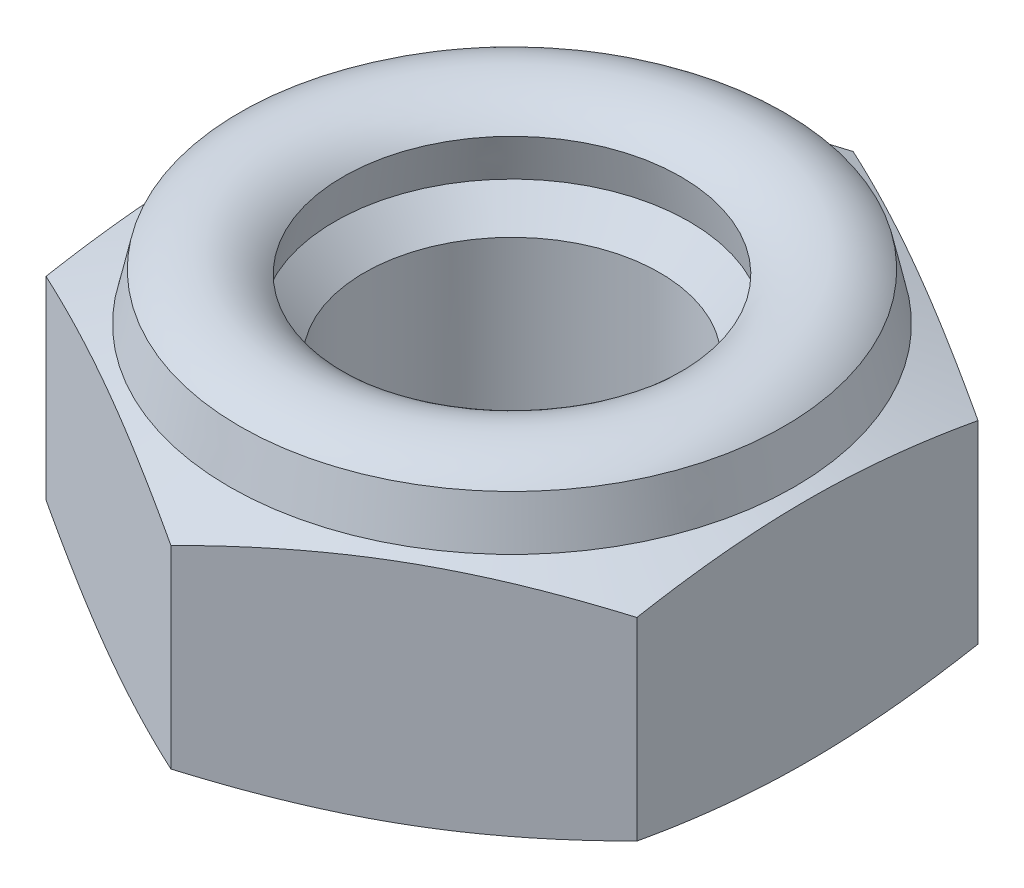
ISO-10303-21;
HEADER;
FILE_DESCRIPTION(('STEP AP214'),'2;1');
FILE_NAME('part.step','',(''),(''),'','','');
FILE_SCHEMA(('AUTOMOTIVE_DESIGN { 1 0 10303 214 1 1 1 1 }'));
ENDSEC;
DATA;
#1=APPLICATION_CONTEXT('core data for automotive mechanical design processes');
#2=APPLICATION_PROTOCOL_DEFINITION('international standard','automotive_design',2000,#1);
#3=PRODUCT_CONTEXT('',#1,'mechanical');
#4=PRODUCT('Part','Part','',(#3));
#5=PRODUCT_RELATED_PRODUCT_CATEGORY('part','',(#4));
#6=PRODUCT_DEFINITION_FORMATION('','',#4);
#7=PRODUCT_DEFINITION_CONTEXT('part definition',#1,'design');
#8=PRODUCT_DEFINITION('design','',#6,#7);
#9=PRODUCT_DEFINITION_SHAPE('','',#8);
#10=(LENGTH_UNIT() NAMED_UNIT(*) SI_UNIT(.MILLI.,.METRE.));
#11=(NAMED_UNIT(*) PLANE_ANGLE_UNIT() SI_UNIT($,.RADIAN.));
#12=(NAMED_UNIT(*) SI_UNIT($,.STERADIAN.) SOLID_ANGLE_UNIT());
#13=UNCERTAINTY_MEASURE_WITH_UNIT(LENGTH_MEASURE(1.E-05),#10,'distance_accuracy_value','');
#14=(GEOMETRIC_REPRESENTATION_CONTEXT(3) GLOBAL_UNCERTAINTY_ASSIGNED_CONTEXT((#13)) GLOBAL_UNIT_ASSIGNED_CONTEXT((#10,
#11,#12)) REPRESENTATION_CONTEXT('',''));
#15=CARTESIAN_POINT('',(0.,0.,0.));
#16=DIRECTION('',(0.,0.,1.));
#17=DIRECTION('',(1.,0.,0.));
#18=AXIS2_PLACEMENT_3D('',#15,#16,#17);
#19=CARTESIAN_POINT('',(-2.,1.6,1.15470053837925));
#20=DIRECTION('',(0.5,0.,-0.866025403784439));
#21=DIRECTION('',(-0.866025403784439,0.,-0.5));
#22=AXIS2_PLACEMENT_3D('',#19,#20,#21);
#23=PLANE('',#22);
#24=CARTESIAN_POINT('',(0.0002,0.144534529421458,2.30951654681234));
#25=CARTESIAN_POINT('',(-0.0826408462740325,0.127118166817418,2.26168836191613));
#26=CARTESIAN_POINT('',(-0.165754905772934,0.111274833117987,2.213702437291));
#27=CARTESIAN_POINT('',(-0.332523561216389,0.0834007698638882,2.11741850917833));
#28=CARTESIAN_POINT('',(-0.416178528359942,0.0713730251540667,2.06912029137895));
#29=CARTESIAN_POINT('',(-0.583100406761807,0.0519184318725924,1.97274789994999));
#30=CARTESIAN_POINT('',(-0.666363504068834,0.0444491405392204,1.92467592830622));
#31=CARTESIAN_POINT('',(-0.833084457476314,0.0344307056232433,1.82841954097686));
#32=CARTESIAN_POINT('',(-0.916542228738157,0.0318797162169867,1.78023517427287));
#33=CARTESIAN_POINT('',(-1.08345777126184,0.0318797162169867,1.68386644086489));
#34=CARTESIAN_POINT('',(-1.16691554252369,0.0344307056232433,1.6356820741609));
#35=CARTESIAN_POINT('',(-1.33363649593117,0.0444491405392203,1.53942568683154));
#36=CARTESIAN_POINT('',(-1.41689959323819,0.0519184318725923,1.49135371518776));
#37=CARTESIAN_POINT('',(-1.58382147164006,0.0713730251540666,1.39498132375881));
#38=CARTESIAN_POINT('',(-1.66747643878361,0.0834007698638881,1.34668310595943));
#39=CARTESIAN_POINT('',(-1.83424509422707,0.111274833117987,1.25039917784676));
#40=CARTESIAN_POINT('',(-1.91735915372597,0.127118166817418,1.20241325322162));
#41=CARTESIAN_POINT('',(-2.0002,0.144534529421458,1.15458506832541));
#42=B_SPLINE_CURVE_WITH_KNOTS('',3,(#24,#25,#26,#27,#28,#29,#30,#31,#32,#33,#34,#35,#36,#37,#38,
#39,#40,#41),.UNSPECIFIED.,.F.,.F.,(4,2,2,2,2,2,2,2,4),(0.,0.291716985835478,0.583661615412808,
0.872844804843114,1.16191944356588,1.45099408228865,1.74017727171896,2.03212190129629,
2.32383888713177),.UNSPECIFIED.);
#43=CARTESIAN_POINT('',(0.,0.144492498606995,2.3094010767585));
#44=VERTEX_POINT('',#43);
#45=CARTESIAN_POINT('',(-2.,0.144492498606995,1.15470053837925));
#46=VERTEX_POINT('',#45);
#47=EDGE_CURVE('E49',#44,#46,#42,.T.);
#48=ORIENTED_EDGE('',*,*,#47,.F.);
#49=DIRECTION('',(0.,-1.,0.));
#50=VECTOR('',#49,1.);
#51=CARTESIAN_POINT('',(0.,1.6,2.3094010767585));
#52=LINE('',#51,#50);
#53=CARTESIAN_POINT('',(0.,1.45550750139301,2.3094010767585));
#54=VERTEX_POINT('',#53);
#55=EDGE_CURVE('E98',#54,#44,#52,.T.);
#56=ORIENTED_EDGE('',*,*,#55,.F.);
#57=CARTESIAN_POINT('',(-2.0002,1.45546547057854,1.15458506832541));
#58=CARTESIAN_POINT('',(-1.91735915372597,1.47288183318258,1.20241325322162));
#59=CARTESIAN_POINT('',(-1.83424509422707,1.48872516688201,1.25039917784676));
#60=CARTESIAN_POINT('',(-1.66747643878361,1.51659923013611,1.34668310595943));
#61=CARTESIAN_POINT('',(-1.58382147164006,1.52862697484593,1.39498132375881));
#62=CARTESIAN_POINT('',(-1.41689959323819,1.54808156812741,1.49135371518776));
#63=CARTESIAN_POINT('',(-1.33363649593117,1.55555085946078,1.53942568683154));
#64=CARTESIAN_POINT('',(-1.16691554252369,1.56556929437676,1.6356820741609));
#65=CARTESIAN_POINT('',(-1.08345777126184,1.56812028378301,1.68386644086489));
#66=CARTESIAN_POINT('',(-0.916542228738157,1.56812028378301,1.78023517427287));
#67=CARTESIAN_POINT('',(-0.833084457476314,1.56556929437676,1.82841954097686));
#68=CARTESIAN_POINT('',(-0.666363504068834,1.55555085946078,1.92467592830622));
#69=CARTESIAN_POINT('',(-0.583100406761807,1.54808156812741,1.97274789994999));
#70=CARTESIAN_POINT('',(-0.416178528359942,1.52862697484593,2.06912029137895));
#71=CARTESIAN_POINT('',(-0.332523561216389,1.51659923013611,2.11741850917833));
#72=CARTESIAN_POINT('',(-0.165754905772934,1.48872516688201,2.213702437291));
#73=CARTESIAN_POINT('',(-0.0826408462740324,1.47288183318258,2.26168836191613));
#74=CARTESIAN_POINT('',(0.000200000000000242,1.45546547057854,2.30951654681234));
#75=B_SPLINE_CURVE_WITH_KNOTS('',3,(#57,#58,#59,#60,#61,#62,#63,#64,#65,#66,#67,#68,#69,#70,#71,
#72,#73,#74),.UNSPECIFIED.,.F.,.F.,(4,2,2,2,2,2,2,2,4),(0.,0.291716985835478,0.583661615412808,
0.872844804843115,1.16191944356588,1.45099408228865,1.74017727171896,2.03212190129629,
2.32383888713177),.UNSPECIFIED.);
#76=CARTESIAN_POINT('',(-2.,1.45550750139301,1.15470053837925));
#77=VERTEX_POINT('',#76);
#78=EDGE_CURVE('E241',#77,#54,#75,.T.);
#79=ORIENTED_EDGE('',*,*,#78,.F.);
#80=DIRECTION('',(0.,-1.,0.));
#81=VECTOR('',#80,1.);
#82=CARTESIAN_POINT('',(-2.,1.6,1.15470053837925));
#83=LINE('',#82,#81);
#84=EDGE_CURVE('E100',#77,#46,#83,.T.);
#85=ORIENTED_EDGE('',*,*,#84,.T.);
#86=EDGE_LOOP('',(#48,#56,#79,#85));
#87=FACE_BOUND('',#86,.T.);
#88=ADVANCED_FACE('F34',(#87),#23,.F.);
#89=CARTESIAN_POINT('',(0.,1.6,2.3094010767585));
#90=DIRECTION('',(-0.5,0.,-0.866025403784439));
#91=DIRECTION('',(-0.866025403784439,0.,0.5));
#92=AXIS2_PLACEMENT_3D('',#89,#90,#91);
#93=PLANE('',#92);
#94=CARTESIAN_POINT('',(2.0002,0.144534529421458,1.15458506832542));
#95=CARTESIAN_POINT('',(1.91735915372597,0.127118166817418,1.20241325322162));
#96=CARTESIAN_POINT('',(1.83424509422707,0.111274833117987,1.25039917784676));
#97=CARTESIAN_POINT('',(1.66747643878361,0.0834007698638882,1.34668310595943));
#98=CARTESIAN_POINT('',(1.58382147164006,0.0713730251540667,1.39498132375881));
#99=CARTESIAN_POINT('',(1.41689959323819,0.0519184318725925,1.49135371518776));
#100=CARTESIAN_POINT('',(1.33363649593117,0.0444491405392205,1.53942568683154));
#101=CARTESIAN_POINT('',(1.16691554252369,0.0344307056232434,1.6356820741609));
#102=CARTESIAN_POINT('',(1.08345777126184,0.0318797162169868,1.68386644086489));
#103=CARTESIAN_POINT('',(0.916542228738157,0.0318797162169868,1.78023517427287));
#104=CARTESIAN_POINT('',(0.833084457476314,0.0344307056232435,1.82841954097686));
#105=CARTESIAN_POINT('',(0.666363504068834,0.0444491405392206,1.92467592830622));
#106=CARTESIAN_POINT('',(0.583100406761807,0.0519184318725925,1.97274789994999));
#107=CARTESIAN_POINT('',(0.416178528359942,0.0713730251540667,2.06912029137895));
#108=CARTESIAN_POINT('',(0.332523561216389,0.0834007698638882,2.11741850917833));
#109=CARTESIAN_POINT('',(0.165754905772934,0.111274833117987,2.213702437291));
#110=CARTESIAN_POINT('',(0.0826408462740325,0.127118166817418,2.26168836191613));
#111=CARTESIAN_POINT('',(-0.000199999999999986,0.144534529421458,2.30951654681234));
#112=B_SPLINE_CURVE_WITH_KNOTS('',3,(#94,#95,#96,#97,#98,#99,#100,#101,#102,#103,#104,#105,#106,
#107,#108,#109,#110,#111),.UNSPECIFIED.,.F.,.F.,(4,2,2,2,2,2,2,2,4),(0.,0.291716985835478,
0.583661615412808,0.872844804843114,1.16191944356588,1.45099408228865,1.74017727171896,
2.03212190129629,2.32383888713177),.UNSPECIFIED.);
#113=CARTESIAN_POINT('',(2.,0.144492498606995,1.15470053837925));
#114=VERTEX_POINT('',#113);
#115=EDGE_CURVE('E85',#114,#44,#112,.T.);
#116=ORIENTED_EDGE('',*,*,#115,.F.);
#117=DIRECTION('',(0.,-1.,0.));
#118=VECTOR('',#117,1.);
#119=CARTESIAN_POINT('',(2.,1.6,1.15470053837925));
#120=LINE('',#119,#118);
#121=CARTESIAN_POINT('',(2.,1.45550750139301,1.15470053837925));
#122=VERTEX_POINT('',#121);
#123=EDGE_CURVE('E107',#122,#114,#120,.T.);
#124=ORIENTED_EDGE('',*,*,#123,.F.);
#125=CARTESIAN_POINT('',(-0.000200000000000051,1.45546547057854,2.30951654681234));
#126=CARTESIAN_POINT('',(0.0826408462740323,1.47288183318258,2.26168836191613));
#127=CARTESIAN_POINT('',(0.165754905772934,1.48872516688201,2.213702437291));
#128=CARTESIAN_POINT('',(0.332523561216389,1.51659923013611,2.11741850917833));
#129=CARTESIAN_POINT('',(0.416178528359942,1.52862697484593,2.06912029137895));
#130=CARTESIAN_POINT('',(0.583100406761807,1.54808156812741,1.97274789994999));
#131=CARTESIAN_POINT('',(0.666363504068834,1.55555085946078,1.92467592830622));
#132=CARTESIAN_POINT('',(0.833084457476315,1.56556929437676,1.82841954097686));
#133=CARTESIAN_POINT('',(0.916542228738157,1.56812028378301,1.78023517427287));
#134=CARTESIAN_POINT('',(1.08345777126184,1.56812028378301,1.68386644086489));
#135=CARTESIAN_POINT('',(1.16691554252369,1.56556929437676,1.6356820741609));
#136=CARTESIAN_POINT('',(1.33363649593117,1.55555085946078,1.53942568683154));
#137=CARTESIAN_POINT('',(1.41689959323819,1.54808156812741,1.49135371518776));
#138=CARTESIAN_POINT('',(1.58382147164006,1.52862697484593,1.39498132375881));
#139=CARTESIAN_POINT('',(1.66747643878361,1.51659923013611,1.34668310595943));
#140=CARTESIAN_POINT('',(1.83424509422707,1.48872516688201,1.25039917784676));
#141=CARTESIAN_POINT('',(1.91735915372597,1.47288183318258,1.20241325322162));
#142=CARTESIAN_POINT('',(2.0002,1.45546547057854,1.15458506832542));
#143=B_SPLINE_CURVE_WITH_KNOTS('',3,(#125,#126,#127,#128,#129,#130,#131,#132,#133,#134,#135,
#136,#137,#138,#139,#140,#141,#142),.UNSPECIFIED.,.F.,.F.,(4,2,2,2,2,2,2,2,4),(0.,
0.291716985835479,0.583661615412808,0.872844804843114,1.16191944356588,1.45099408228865,
1.74017727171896,2.03212190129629,2.32383888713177),.UNSPECIFIED.);
#144=EDGE_CURVE('E105',#54,#122,#143,.T.);
#145=ORIENTED_EDGE('',*,*,#144,.F.);
#146=ORIENTED_EDGE('',*,*,#55,.T.);
#147=EDGE_LOOP('',(#116,#124,#145,#146));
#148=FACE_BOUND('',#147,.T.);
#149=ADVANCED_FACE('F104',(#148),#93,.F.);
#150=CARTESIAN_POINT('',(2.,1.6,1.15470053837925));
#151=DIRECTION('',(-1.,0.,0.));
#152=DIRECTION('',(0.,0.,1.));
#153=AXIS2_PLACEMENT_3D('',#150,#151,#152);
#154=PLANE('',#153);
#155=CARTESIAN_POINT('',(2.,0.632713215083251,-3.0542051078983));
#156=CARTESIAN_POINT('',(2.,0.605177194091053,-2.96374893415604));
#157=CARTESIAN_POINT('',(2.,0.577963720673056,-2.87319296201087));
#158=CARTESIAN_POINT('',(2.,0.524358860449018,-2.69183051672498));
#159=CARTESIAN_POINT('',(2.,0.497967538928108,-2.60102402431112));
#160=CARTESIAN_POINT('',(2.,0.446139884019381,-2.41895353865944));
#161=CARTESIAN_POINT('',(2.,0.420705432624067,-2.32768900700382));
#162=CARTESIAN_POINT('',(2.,0.371095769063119,-2.14482034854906));
#163=CARTESIAN_POINT('',(2.,0.346920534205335,-2.05321622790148));
#164=CARTESIAN_POINT('',(2.,0.277299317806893,-1.78008437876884));
#165=CARTESIAN_POINT('',(2.,0.234099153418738,-1.59797331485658));
#166=CARTESIAN_POINT('',(2.,0.157133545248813,-1.23174559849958));
#167=CARTESIAN_POINT('',(2.,0.123364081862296,-1.04762983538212));
#168=CARTESIAN_POINT('',(2.,0.0848380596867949,-0.7802925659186));
#169=CARTESIAN_POINT('',(2.,0.0743898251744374,-0.697892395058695));
#170=CARTESIAN_POINT('',(2.,0.0567153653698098,-0.532751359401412));
#171=CARTESIAN_POINT('',(2.,0.0494887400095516,-0.450010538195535));
#172=CARTESIAN_POINT('',(2.,0.0386025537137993,-0.284345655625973));
#173=CARTESIAN_POINT('',(2.,0.0349406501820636,-0.201421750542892));
#174=CARTESIAN_POINT('',(2.,0.0313701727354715,-0.0354922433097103));
#175=CARTESIAN_POINT('',(2.,0.031461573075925,0.047513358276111));
#176=CARTESIAN_POINT('',(2.,0.0354025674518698,0.21385588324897));
#177=CARTESIAN_POINT('',(2.,0.0392712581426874,0.29719234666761));
#178=CARTESIAN_POINT('',(2.,0.0505892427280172,0.463622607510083));
#179=CARTESIAN_POINT('',(2.,0.0580387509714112,0.546716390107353));
#180=CARTESIAN_POINT('',(2.,0.0761696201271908,0.712616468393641));
#181=CARTESIAN_POINT('',(2.,0.0868536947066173,0.795422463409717));
#182=CARTESIAN_POINT('',(2.,0.111024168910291,0.960619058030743));
#183=CARTESIAN_POINT('',(2.,0.124510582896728,1.04300965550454));
#184=CARTESIAN_POINT('',(2.,0.170131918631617,1.29869517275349));
#185=CARTESIAN_POINT('',(2.,0.206335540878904,1.47126206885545));
#186=CARTESIAN_POINT('',(2.,0.285705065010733,1.81479162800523));
#187=CARTESIAN_POINT('',(2.,0.328873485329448,1.98575368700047));
#188=CARTESIAN_POINT('',(2.,0.419847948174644,2.32666500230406));
#189=CARTESIAN_POINT('',(2.,0.467659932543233,2.49661265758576));
#190=CARTESIAN_POINT('',(2.,0.566353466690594,2.83557588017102));
#191=CARTESIAN_POINT('',(2.,0.617234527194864,3.0045915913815));
#192=CARTESIAN_POINT('',(2.,0.720538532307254,3.3400799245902));
#193=CARTESIAN_POINT('',(2.,0.772937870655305,3.50655984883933));
#194=CARTESIAN_POINT('',(2.,0.879220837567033,3.83905249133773));
#195=CARTESIAN_POINT('',(2.,0.933104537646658,4.00506518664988));
#196=CARTESIAN_POINT('',(2.,1.04174689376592,4.33610496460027));
#197=CARTESIAN_POINT('',(2.,1.09650145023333,4.50113339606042));
#198=CARTESIAN_POINT('',(2.,1.20682898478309,4.83090156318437));
#199=CARTESIAN_POINT('',(2.,1.26240189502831,4.99564132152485));
#200=CARTESIAN_POINT('',(2.,1.3182610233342,5.16028257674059));
#201=B_SPLINE_CURVE_WITH_KNOTS('',3,(#155,#156,#157,#158,#159,#160,#161,#162,#163,#164,#165,
#166,#167,#168,#169,#170,#171,#172,#173,#174,#175,#176,#177,#178,#179,#180,#181,#182,#183,#184,
#185,#186,#187,#188,#189,#190,#191,#192,#193,#194,#195,#196,#197,#198,#199,#200),.UNSPECIFIED.,
.F.,.F.,(4,2,2,2,2,2,2,2,2,2,2,2,2,2,2,2,2,2,2,2,2,2,4),(0.,0.283665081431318,0.567352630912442,
0.851571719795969,1.13578568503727,1.69714355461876,2.2582617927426,2.50738893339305,
2.75648512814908,3.00541751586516,3.25434819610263,3.50454393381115,3.75475465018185,
4.00517586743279,4.25559836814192,4.7843116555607,5.3132165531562,5.8428073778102,
6.37231399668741,6.89589910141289,7.41950947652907,7.94113149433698,8.46271051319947),.UNSPECIFIED.);
#202=CARTESIAN_POINT('',(2.,0.144492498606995,-1.15470053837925));
#203=VERTEX_POINT('',#202);
#204=EDGE_CURVE('E88',#203,#114,#201,.T.);
#205=ORIENTED_EDGE('',*,*,#204,.F.);
#206=DIRECTION('',(0.,-1.,0.));
#207=VECTOR('',#206,1.);
#208=CARTESIAN_POINT('',(2.,1.6,-1.15470053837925));
#209=LINE('',#208,#207);
#210=CARTESIAN_POINT('',(2.,1.45550750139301,-1.15470053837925));
#211=VERTEX_POINT('',#210);
#212=EDGE_CURVE('E112',#211,#203,#209,.T.);
#213=ORIENTED_EDGE('',*,*,#212,.F.);
#214=CARTESIAN_POINT('',(2.,0.96728678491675,-3.0542051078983));
#215=CARTESIAN_POINT('',(2.,0.994822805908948,-2.96374893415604));
#216=CARTESIAN_POINT('',(2.,1.02203627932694,-2.87319296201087));
#217=CARTESIAN_POINT('',(2.,1.07564113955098,-2.69183051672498));
#218=CARTESIAN_POINT('',(2.,1.10203246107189,-2.60102402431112));
#219=CARTESIAN_POINT('',(2.,1.15386011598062,-2.41895353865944));
#220=CARTESIAN_POINT('',(2.,1.17929456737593,-2.32768900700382));
#221=CARTESIAN_POINT('',(2.,1.22890423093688,-2.14482034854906));
#222=CARTESIAN_POINT('',(2.,1.25307946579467,-2.05321622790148));
#223=CARTESIAN_POINT('',(2.,1.32270068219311,-1.78008437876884));
#224=CARTESIAN_POINT('',(2.,1.36590084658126,-1.59797331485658));
#225=CARTESIAN_POINT('',(2.,1.44286645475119,-1.23174559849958));
#226=CARTESIAN_POINT('',(2.,1.4766359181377,-1.04762983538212));
#227=CARTESIAN_POINT('',(2.,1.51516194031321,-0.780292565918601));
#228=CARTESIAN_POINT('',(2.,1.52561017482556,-0.697892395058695));
#229=CARTESIAN_POINT('',(2.,1.54328463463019,-0.532751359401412));
#230=CARTESIAN_POINT('',(2.,1.55051125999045,-0.450010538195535));
#231=CARTESIAN_POINT('',(2.,1.5613974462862,-0.284345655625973));
#232=CARTESIAN_POINT('',(2.,1.56505934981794,-0.201421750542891));
#233=CARTESIAN_POINT('',(2.,1.56862982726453,-0.0354922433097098));
#234=CARTESIAN_POINT('',(2.,1.56853842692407,0.0475133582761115));
#235=CARTESIAN_POINT('',(2.,1.56459743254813,0.213855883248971));
#236=CARTESIAN_POINT('',(2.,1.56072874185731,0.297192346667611));
#237=CARTESIAN_POINT('',(2.,1.54941075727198,0.463622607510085));
#238=CARTESIAN_POINT('',(2.,1.54196124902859,0.546716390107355));
#239=CARTESIAN_POINT('',(2.,1.52383037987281,0.712616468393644));
#240=CARTESIAN_POINT('',(2.,1.51314630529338,0.79542246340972));
#241=CARTESIAN_POINT('',(2.,1.48897583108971,0.960619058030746));
#242=CARTESIAN_POINT('',(2.,1.47548941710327,1.04300965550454));
#243=CARTESIAN_POINT('',(2.,1.42986808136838,1.29869517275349));
#244=CARTESIAN_POINT('',(2.,1.3936644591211,1.47126206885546));
#245=CARTESIAN_POINT('',(2.,1.31429493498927,1.81479162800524));
#246=CARTESIAN_POINT('',(2.,1.27112651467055,1.98575368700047));
#247=CARTESIAN_POINT('',(2.,1.18015205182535,2.32666500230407));
#248=CARTESIAN_POINT('',(2.,1.13234006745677,2.49661265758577));
#249=CARTESIAN_POINT('',(2.,1.0336465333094,2.83557588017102));
#250=CARTESIAN_POINT('',(2.,0.982765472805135,3.0045915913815));
#251=CARTESIAN_POINT('',(2.,0.879461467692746,3.3400799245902));
#252=CARTESIAN_POINT('',(2.,0.827062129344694,3.50655984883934));
#253=CARTESIAN_POINT('',(2.,0.720779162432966,3.83905249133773));
#254=CARTESIAN_POINT('',(2.,0.666895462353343,4.00506518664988));
#255=CARTESIAN_POINT('',(2.,0.558253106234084,4.33610496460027));
#256=CARTESIAN_POINT('',(2.,0.503498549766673,4.50113339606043));
#257=CARTESIAN_POINT('',(2.,0.393171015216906,4.83090156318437));
#258=CARTESIAN_POINT('',(2.,0.33759810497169,4.99564132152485));
#259=CARTESIAN_POINT('',(2.,0.281738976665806,5.16028257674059));
#260=B_SPLINE_CURVE_WITH_KNOTS('',3,(#214,#215,#216,#217,#218,#219,#220,#221,#222,#223,#224,
#225,#226,#227,#228,#229,#230,#231,#232,#233,#234,#235,#236,#237,#238,#239,#240,#241,#242,#243,
#244,#245,#246,#247,#248,#249,#250,#251,#252,#253,#254,#255,#256,#257,#258,#259),.UNSPECIFIED.,
.F.,.F.,(4,2,2,2,2,2,2,2,2,2,2,2,2,2,2,2,2,2,2,2,2,2,4),(0.,0.283665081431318,0.567352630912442,
0.851571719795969,1.13578568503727,1.69714355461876,2.25826179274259,2.50738893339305,
2.75648512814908,3.00541751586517,3.25434819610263,3.50454393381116,3.75475465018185,
4.0051758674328,4.25559836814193,4.7843116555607,5.31321655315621,5.8428073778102,
6.37231399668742,6.8958991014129,7.41950947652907,7.94113149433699,8.46271051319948),.UNSPECIFIED.);
#261=EDGE_CURVE('E229',#122,#211,#260,.F.);
#262=ORIENTED_EDGE('',*,*,#261,.F.);
#263=ORIENTED_EDGE('',*,*,#123,.T.);
#264=EDGE_LOOP('',(#205,#213,#262,#263));
#265=FACE_BOUND('',#264,.T.);
#266=ADVANCED_FACE('F152',(#265),#154,.F.);
#267=CARTESIAN_POINT('',(2.,1.6,-1.15470053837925));
#268=DIRECTION('',(-0.5,0.,0.866025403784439));
#269=DIRECTION('',(0.866025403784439,0.,0.5));
#270=AXIS2_PLACEMENT_3D('',#267,#268,#269);
#271=PLANE('',#270);
#272=CARTESIAN_POINT('',(-0.0002,0.144534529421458,-2.30951654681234));
#273=CARTESIAN_POINT('',(0.0826408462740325,0.127118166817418,-2.26168836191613));
#274=CARTESIAN_POINT('',(0.165754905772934,0.111274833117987,-2.213702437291));
#275=CARTESIAN_POINT('',(0.332523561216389,0.0834007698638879,-2.11741850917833));
#276=CARTESIAN_POINT('',(0.416178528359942,0.0713730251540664,-2.06912029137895));
#277=CARTESIAN_POINT('',(0.583100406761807,0.0519184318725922,-1.97274789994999));
#278=CARTESIAN_POINT('',(0.666363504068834,0.0444491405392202,-1.92467592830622));
#279=CARTESIAN_POINT('',(0.833084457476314,0.0344307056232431,-1.82841954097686));
#280=CARTESIAN_POINT('',(0.916542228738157,0.0318797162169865,-1.78023517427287));
#281=CARTESIAN_POINT('',(1.08345777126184,0.0318797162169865,-1.68386644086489));
#282=CARTESIAN_POINT('',(1.16691554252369,0.0344307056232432,-1.6356820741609));
#283=CARTESIAN_POINT('',(1.33363649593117,0.0444491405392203,-1.53942568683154));
#284=CARTESIAN_POINT('',(1.41689959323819,0.0519184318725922,-1.49135371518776));
#285=CARTESIAN_POINT('',(1.58382147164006,0.0713730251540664,-1.39498132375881));
#286=CARTESIAN_POINT('',(1.66747643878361,0.083400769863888,-1.34668310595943));
#287=CARTESIAN_POINT('',(1.83424509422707,0.111274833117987,-1.25039917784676));
#288=CARTESIAN_POINT('',(1.91735915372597,0.127118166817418,-1.20241325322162));
#289=CARTESIAN_POINT('',(2.0002,0.144534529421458,-1.15458506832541));
#290=B_SPLINE_CURVE_WITH_KNOTS('',3,(#272,#273,#274,#275,#276,#277,#278,#279,#280,#281,#282,
#283,#284,#285,#286,#287,#288,#289),.UNSPECIFIED.,.F.,.F.,(4,2,2,2,2,2,2,2,4),(0.,
0.291716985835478,0.583661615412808,0.872844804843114,1.16191944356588,1.45099408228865,
1.74017727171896,2.03212190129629,2.32383888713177),.UNSPECIFIED.);
#291=CARTESIAN_POINT('',(0.,0.144492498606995,-2.3094010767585));
#292=VERTEX_POINT('',#291);
#293=EDGE_CURVE('E211',#292,#203,#290,.T.);
#294=ORIENTED_EDGE('',*,*,#293,.F.);
#295=DIRECTION('',(0.,-1.,0.));
#296=VECTOR('',#295,1.);
#297=CARTESIAN_POINT('',(0.,1.6,-2.3094010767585));
#298=LINE('',#297,#296);
#299=CARTESIAN_POINT('',(0.,1.45550750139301,-2.3094010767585));
#300=VERTEX_POINT('',#299);
#301=EDGE_CURVE('E251',#300,#292,#298,.T.);
#302=ORIENTED_EDGE('',*,*,#301,.F.);
#303=CARTESIAN_POINT('',(2.0002,1.45546547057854,-1.15458506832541));
#304=CARTESIAN_POINT('',(1.91735915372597,1.47288183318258,-1.20241325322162));
#305=CARTESIAN_POINT('',(1.83424509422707,1.48872516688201,-1.25039917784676));
#306=CARTESIAN_POINT('',(1.66747643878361,1.51659923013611,-1.34668310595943));
#307=CARTESIAN_POINT('',(1.58382147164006,1.52862697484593,-1.39498132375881));
#308=CARTESIAN_POINT('',(1.41689959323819,1.54808156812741,-1.49135371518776));
#309=CARTESIAN_POINT('',(1.33363649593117,1.55555085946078,-1.53942568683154));
#310=CARTESIAN_POINT('',(1.16691554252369,1.56556929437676,-1.6356820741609));
#311=CARTESIAN_POINT('',(1.08345777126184,1.56812028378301,-1.68386644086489));
#312=CARTESIAN_POINT('',(0.916542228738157,1.56812028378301,-1.78023517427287));
#313=CARTESIAN_POINT('',(0.833084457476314,1.56556929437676,-1.82841954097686));
#314=CARTESIAN_POINT('',(0.666363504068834,1.55555085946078,-1.92467592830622));
#315=CARTESIAN_POINT('',(0.583100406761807,1.54808156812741,-1.97274789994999));
#316=CARTESIAN_POINT('',(0.416178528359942,1.52862697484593,-2.06912029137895));
#317=CARTESIAN_POINT('',(0.332523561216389,1.51659923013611,-2.11741850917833));
#318=CARTESIAN_POINT('',(0.165754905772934,1.48872516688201,-2.213702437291));
#319=CARTESIAN_POINT('',(0.0826408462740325,1.47288183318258,-2.26168836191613));
#320=CARTESIAN_POINT('',(-0.000200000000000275,1.45546547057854,-2.30951654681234));
#321=B_SPLINE_CURVE_WITH_KNOTS('',3,(#303,#304,#305,#306,#307,#308,#309,#310,#311,#312,#313,
#314,#315,#316,#317,#318,#319,#320),.UNSPECIFIED.,.F.,.F.,(4,2,2,2,2,2,2,2,4),(0.,
0.291716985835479,0.583661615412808,0.872844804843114,1.16191944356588,1.45099408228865,
1.74017727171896,2.03212190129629,2.32383888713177),.UNSPECIFIED.);
#322=EDGE_CURVE('E223',#211,#300,#321,.T.);
#323=ORIENTED_EDGE('',*,*,#322,.F.);
#324=ORIENTED_EDGE('',*,*,#212,.T.);
#325=EDGE_LOOP('',(#294,#302,#323,#324));
#326=FACE_BOUND('',#325,.T.);
#327=ADVANCED_FACE('F156',(#326),#271,.F.);
#328=CARTESIAN_POINT('',(0.,1.6,-2.3094010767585));
#329=DIRECTION('',(0.5,0.,0.866025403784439));
#330=DIRECTION('',(0.866025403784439,0.,-0.5));
#331=AXIS2_PLACEMENT_3D('',#328,#329,#330);
#332=PLANE('',#331);
#333=CARTESIAN_POINT('',(-2.0002,0.144534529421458,-1.15458506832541));
#334=CARTESIAN_POINT('',(-1.91735915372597,0.127118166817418,-1.20241325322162));
#335=CARTESIAN_POINT('',(-1.83424509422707,0.111274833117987,-1.25039917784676));
#336=CARTESIAN_POINT('',(-1.66747643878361,0.0834007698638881,-1.34668310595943));
#337=CARTESIAN_POINT('',(-1.58382147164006,0.0713730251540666,-1.39498132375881));
#338=CARTESIAN_POINT('',(-1.41689959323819,0.0519184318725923,-1.49135371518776));
#339=CARTESIAN_POINT('',(-1.33363649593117,0.0444491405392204,-1.53942568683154));
#340=CARTESIAN_POINT('',(-1.16691554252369,0.0344307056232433,-1.6356820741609));
#341=CARTESIAN_POINT('',(-1.08345777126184,0.0318797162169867,-1.68386644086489));
#342=CARTESIAN_POINT('',(-0.916542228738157,0.0318797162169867,-1.78023517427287));
#343=CARTESIAN_POINT('',(-0.833084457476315,0.0344307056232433,-1.82841954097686));
#344=CARTESIAN_POINT('',(-0.666363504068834,0.0444491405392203,-1.92467592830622));
#345=CARTESIAN_POINT('',(-0.583100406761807,0.0519184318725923,-1.97274789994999));
#346=CARTESIAN_POINT('',(-0.416178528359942,0.0713730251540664,-2.06912029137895));
#347=CARTESIAN_POINT('',(-0.332523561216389,0.0834007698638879,-2.11741850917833));
#348=CARTESIAN_POINT('',(-0.165754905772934,0.111274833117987,-2.213702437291));
#349=CARTESIAN_POINT('',(-0.0826408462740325,0.127118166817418,-2.26168836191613));
#350=CARTESIAN_POINT('',(0.000199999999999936,0.144534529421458,-2.30951654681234));
#351=B_SPLINE_CURVE_WITH_KNOTS('',3,(#333,#334,#335,#336,#337,#338,#339,#340,#341,#342,#343,
#344,#345,#346,#347,#348,#349,#350),.UNSPECIFIED.,.F.,.F.,(4,2,2,2,2,2,2,2,4),(0.,
0.291716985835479,0.583661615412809,0.872844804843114,1.16191944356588,1.45099408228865,
1.74017727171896,2.03212190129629,2.32383888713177),.UNSPECIFIED.);
#352=CARTESIAN_POINT('',(-2.,0.144492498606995,-1.15470053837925));
#353=VERTEX_POINT('',#352);
#354=EDGE_CURVE('E204',#353,#292,#351,.T.);
#355=ORIENTED_EDGE('',*,*,#354,.F.);
#356=DIRECTION('',(0.,-1.,0.));
#357=VECTOR('',#356,1.);
#358=CARTESIAN_POINT('',(-2.,1.6,-1.15470053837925));
#359=LINE('',#358,#357);
#360=CARTESIAN_POINT('',(-2.,1.45550750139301,-1.15470053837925));
#361=VERTEX_POINT('',#360);
#362=EDGE_CURVE('E242',#361,#353,#359,.T.);
#363=ORIENTED_EDGE('',*,*,#362,.F.);
#364=CARTESIAN_POINT('',(0.000200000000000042,1.45546547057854,-2.30951654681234));
#365=CARTESIAN_POINT('',(-0.0826408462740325,1.47288183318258,-2.26168836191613));
#366=CARTESIAN_POINT('',(-0.165754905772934,1.48872516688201,-2.213702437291));
#367=CARTESIAN_POINT('',(-0.332523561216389,1.51659923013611,-2.11741850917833));
#368=CARTESIAN_POINT('',(-0.416178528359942,1.52862697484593,-2.06912029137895));
#369=CARTESIAN_POINT('',(-0.583100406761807,1.54808156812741,-1.97274789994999));
#370=CARTESIAN_POINT('',(-0.666363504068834,1.55555085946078,-1.92467592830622));
#371=CARTESIAN_POINT('',(-0.833084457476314,1.56556929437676,-1.82841954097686));
#372=CARTESIAN_POINT('',(-0.916542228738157,1.56812028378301,-1.78023517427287));
#373=CARTESIAN_POINT('',(-1.08345777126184,1.56812028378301,-1.68386644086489));
#374=CARTESIAN_POINT('',(-1.16691554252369,1.56556929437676,-1.6356820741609));
#375=CARTESIAN_POINT('',(-1.33363649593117,1.55555085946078,-1.53942568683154));
#376=CARTESIAN_POINT('',(-1.41689959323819,1.54808156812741,-1.49135371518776));
#377=CARTESIAN_POINT('',(-1.58382147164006,1.52862697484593,-1.39498132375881));
#378=CARTESIAN_POINT('',(-1.66747643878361,1.51659923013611,-1.34668310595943));
#379=CARTESIAN_POINT('',(-1.83424509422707,1.48872516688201,-1.25039917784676));
#380=CARTESIAN_POINT('',(-1.91735915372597,1.47288183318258,-1.20241325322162));
#381=CARTESIAN_POINT('',(-2.0002,1.45546547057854,-1.15458506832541));
#382=B_SPLINE_CURVE_WITH_KNOTS('',3,(#364,#365,#366,#367,#368,#369,#370,#371,#372,#373,#374,
#375,#376,#377,#378,#379,#380,#381),.UNSPECIFIED.,.F.,.F.,(4,2,2,2,2,2,2,2,4),(0.,
0.291716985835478,0.583661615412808,0.872844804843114,1.16191944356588,1.45099408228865,
1.74017727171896,2.03212190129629,2.32383888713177),.UNSPECIFIED.);
#383=EDGE_CURVE('E57',#300,#361,#382,.T.);
#384=ORIENTED_EDGE('',*,*,#383,.F.);
#385=ORIENTED_EDGE('',*,*,#301,.T.);
#386=EDGE_LOOP('',(#355,#363,#384,#385));
#387=FACE_BOUND('',#386,.T.);
#388=ADVANCED_FACE('F218',(#387),#332,.F.);
#389=CARTESIAN_POINT('',(-2.,1.6,-1.15470053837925));
#390=DIRECTION('',(1.,0.,0.));
#391=DIRECTION('',(0.,0.,-1.));
#392=AXIS2_PLACEMENT_3D('',#389,#390,#391);
#393=PLANE('',#392);
#394=CARTESIAN_POINT('',(-2.,0.632713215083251,-3.0542051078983));
#395=CARTESIAN_POINT('',(-2.,0.605177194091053,-2.96374893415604));
#396=CARTESIAN_POINT('',(-2.,0.577963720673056,-2.87319296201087));
#397=CARTESIAN_POINT('',(-2.,0.524358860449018,-2.69183051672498));
#398=CARTESIAN_POINT('',(-2.,0.497967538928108,-2.60102402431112));
#399=CARTESIAN_POINT('',(-2.,0.446139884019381,-2.41895353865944));
#400=CARTESIAN_POINT('',(-2.,0.420705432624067,-2.32768900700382));
#401=CARTESIAN_POINT('',(-2.,0.371095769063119,-2.14482034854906));
#402=CARTESIAN_POINT('',(-2.,0.346920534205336,-2.05321622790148));
#403=CARTESIAN_POINT('',(-2.,0.277299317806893,-1.78008437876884));
#404=CARTESIAN_POINT('',(-2.,0.234099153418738,-1.59797331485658));
#405=CARTESIAN_POINT('',(-2.,0.157133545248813,-1.23174559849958));
#406=CARTESIAN_POINT('',(-2.,0.123364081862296,-1.04762983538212));
#407=CARTESIAN_POINT('',(-2.,0.0848380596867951,-0.7802925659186));
#408=CARTESIAN_POINT('',(-2.,0.0743898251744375,-0.697892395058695));
#409=CARTESIAN_POINT('',(-2.,0.05671536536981,-0.532751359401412));
#410=CARTESIAN_POINT('',(-2.,0.0494887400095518,-0.450010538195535));
#411=CARTESIAN_POINT('',(-2.,0.0386025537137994,-0.284345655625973));
#412=CARTESIAN_POINT('',(-2.,0.0349406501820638,-0.201421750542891));
#413=CARTESIAN_POINT('',(-2.,0.0313701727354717,-0.0354922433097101));
#414=CARTESIAN_POINT('',(-2.,0.0314615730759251,0.047513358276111));
#415=CARTESIAN_POINT('',(-2.,0.03540256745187,0.21385588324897));
#416=CARTESIAN_POINT('',(-2.,0.0392712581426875,0.29719234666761));
#417=CARTESIAN_POINT('',(-2.,0.0505892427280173,0.463622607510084));
#418=CARTESIAN_POINT('',(-2.,0.0580387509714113,0.546716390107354));
#419=CARTESIAN_POINT('',(-2.,0.076169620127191,0.712616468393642));
#420=CARTESIAN_POINT('',(-2.,0.0868536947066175,0.795422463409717));
#421=CARTESIAN_POINT('',(-2.,0.111024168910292,0.960619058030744));
#422=CARTESIAN_POINT('',(-2.,0.124510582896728,1.04300965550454));
#423=CARTESIAN_POINT('',(-2.,0.170131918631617,1.29869517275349));
#424=CARTESIAN_POINT('',(-2.,0.206335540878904,1.47126206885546));
#425=CARTESIAN_POINT('',(-2.,0.285705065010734,1.81479162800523));
#426=CARTESIAN_POINT('',(-2.,0.328873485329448,1.98575368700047));
#427=CARTESIAN_POINT('',(-2.,0.419847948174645,2.32666500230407));
#428=CARTESIAN_POINT('',(-2.,0.467659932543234,2.49661265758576));
#429=CARTESIAN_POINT('',(-2.,0.566353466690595,2.83557588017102));
#430=CARTESIAN_POINT('',(-2.,0.617234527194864,3.0045915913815));
#431=CARTESIAN_POINT('',(-2.,0.720538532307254,3.3400799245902));
#432=CARTESIAN_POINT('',(-2.,0.772937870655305,3.50655984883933));
#433=CARTESIAN_POINT('',(-2.,0.879220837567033,3.83905249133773));
#434=CARTESIAN_POINT('',(-2.,0.933104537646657,4.00506518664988));
#435=CARTESIAN_POINT('',(-2.,1.04174689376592,4.33610496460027));
#436=CARTESIAN_POINT('',(-2.,1.09650145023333,4.50113339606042));
#437=CARTESIAN_POINT('',(-2.,1.20682898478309,4.83090156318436));
#438=CARTESIAN_POINT('',(-2.,1.26240189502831,4.99564132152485));
#439=CARTESIAN_POINT('',(-2.,1.31826102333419,5.16028257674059));
#440=B_SPLINE_CURVE_WITH_KNOTS('',3,(#394,#395,#396,#397,#398,#399,#400,#401,#402,#403,#404,
#405,#406,#407,#408,#409,#410,#411,#412,#413,#414,#415,#416,#417,#418,#419,#420,#421,#422,#423,
#424,#425,#426,#427,#428,#429,#430,#431,#432,#433,#434,#435,#436,#437,#438,#439),.UNSPECIFIED.,
.F.,.F.,(4,2,2,2,2,2,2,2,2,2,2,2,2,2,2,2,2,2,2,2,2,2,4),(0.,0.283665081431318,0.567352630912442,
0.851571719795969,1.13578568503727,1.69714355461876,2.2582617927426,2.50738893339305,
2.75648512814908,3.00541751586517,3.25434819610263,3.50454393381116,3.75475465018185,
4.00517586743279,4.25559836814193,4.7843116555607,5.31321655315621,5.8428073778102,
6.37231399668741,6.8958991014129,7.41950947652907,7.94113149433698,8.46271051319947),.UNSPECIFIED.);
#441=EDGE_CURVE('E194',#46,#353,#440,.F.);
#442=ORIENTED_EDGE('',*,*,#441,.F.);
#443=ORIENTED_EDGE('',*,*,#84,.F.);
#444=CARTESIAN_POINT('',(-2.,0.96728678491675,-3.0542051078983));
#445=CARTESIAN_POINT('',(-2.,0.994822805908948,-2.96374893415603));
#446=CARTESIAN_POINT('',(-2.,1.02203627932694,-2.87319296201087));
#447=CARTESIAN_POINT('',(-2.,1.07564113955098,-2.69183051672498));
#448=CARTESIAN_POINT('',(-2.,1.10203246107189,-2.60102402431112));
#449=CARTESIAN_POINT('',(-2.,1.15386011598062,-2.41895353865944));
#450=CARTESIAN_POINT('',(-2.,1.17929456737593,-2.32768900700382));
#451=CARTESIAN_POINT('',(-2.,1.22890423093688,-2.14482034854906));
#452=CARTESIAN_POINT('',(-2.,1.25307946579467,-2.05321622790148));
#453=CARTESIAN_POINT('',(-2.,1.32270068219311,-1.78008437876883));
#454=CARTESIAN_POINT('',(-2.,1.36590084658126,-1.59797331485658));
#455=CARTESIAN_POINT('',(-2.,1.44286645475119,-1.23174559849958));
#456=CARTESIAN_POINT('',(-2.,1.4766359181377,-1.04762983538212));
#457=CARTESIAN_POINT('',(-2.,1.51516194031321,-0.780292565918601));
#458=CARTESIAN_POINT('',(-2.,1.52561017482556,-0.697892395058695));
#459=CARTESIAN_POINT('',(-2.,1.54328463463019,-0.532751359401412));
#460=CARTESIAN_POINT('',(-2.,1.55051125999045,-0.450010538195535));
#461=CARTESIAN_POINT('',(-2.,1.5613974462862,-0.284345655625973));
#462=CARTESIAN_POINT('',(-2.,1.56505934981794,-0.201421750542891));
#463=CARTESIAN_POINT('',(-2.,1.56862982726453,-0.0354922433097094));
#464=CARTESIAN_POINT('',(-2.,1.56853842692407,0.047513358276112));
#465=CARTESIAN_POINT('',(-2.,1.56459743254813,0.213855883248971));
#466=CARTESIAN_POINT('',(-2.,1.56072874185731,0.297192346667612));
#467=CARTESIAN_POINT('',(-2.,1.54941075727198,0.463622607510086));
#468=CARTESIAN_POINT('',(-2.,1.54196124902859,0.546716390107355));
#469=CARTESIAN_POINT('',(-2.,1.52383037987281,0.712616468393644));
#470=CARTESIAN_POINT('',(-2.,1.51314630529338,0.79542246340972));
#471=CARTESIAN_POINT('',(-2.,1.48897583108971,0.960619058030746));
#472=CARTESIAN_POINT('',(-2.,1.47548941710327,1.04300965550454));
#473=CARTESIAN_POINT('',(-2.,1.42986808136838,1.29869517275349));
#474=CARTESIAN_POINT('',(-2.,1.3936644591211,1.47126206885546));
#475=CARTESIAN_POINT('',(-2.,1.31429493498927,1.81479162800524));
#476=CARTESIAN_POINT('',(-2.,1.27112651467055,1.98575368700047));
#477=CARTESIAN_POINT('',(-2.,1.18015205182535,2.32666500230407));
#478=CARTESIAN_POINT('',(-2.,1.13234006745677,2.49661265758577));
#479=CARTESIAN_POINT('',(-2.,1.0336465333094,2.83557588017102));
#480=CARTESIAN_POINT('',(-2.,0.982765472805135,3.0045915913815));
#481=CARTESIAN_POINT('',(-2.,0.879461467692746,3.3400799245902));
#482=CARTESIAN_POINT('',(-2.,0.827062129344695,3.50655984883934));
#483=CARTESIAN_POINT('',(-2.,0.720779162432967,3.83905249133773));
#484=CARTESIAN_POINT('',(-2.,0.666895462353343,4.00506518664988));
#485=CARTESIAN_POINT('',(-2.,0.558253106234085,4.33610496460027));
#486=CARTESIAN_POINT('',(-2.,0.503498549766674,4.50113339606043));
#487=CARTESIAN_POINT('',(-2.,0.393171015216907,4.83090156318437));
#488=CARTESIAN_POINT('',(-2.,0.337598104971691,4.99564132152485));
#489=CARTESIAN_POINT('',(-2.,0.281738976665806,5.16028257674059));
#490=B_SPLINE_CURVE_WITH_KNOTS('',3,(#444,#445,#446,#447,#448,#449,#450,#451,#452,#453,#454,
#455,#456,#457,#458,#459,#460,#461,#462,#463,#464,#465,#466,#467,#468,#469,#470,#471,#472,#473,
#474,#475,#476,#477,#478,#479,#480,#481,#482,#483,#484,#485,#486,#487,#488,#489),.UNSPECIFIED.,
.F.,.F.,(4,2,2,2,2,2,2,2,2,2,2,2,2,2,2,2,2,2,2,2,2,2,4),(0.,0.283665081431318,0.567352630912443,
0.851571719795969,1.13578568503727,1.69714355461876,2.25826179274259,2.50738893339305,
2.75648512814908,3.00541751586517,3.25434819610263,3.50454393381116,3.75475465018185,
4.00517586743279,4.25559836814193,4.7843116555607,5.31321655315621,5.8428073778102,
6.37231399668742,6.8958991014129,7.41950947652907,7.94113149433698,8.46271051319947),.UNSPECIFIED.);
#491=EDGE_CURVE('E260',#361,#77,#490,.T.);
#492=ORIENTED_EDGE('',*,*,#491,.F.);
#493=ORIENTED_EDGE('',*,*,#362,.T.);
#494=EDGE_LOOP('',(#442,#443,#492,#493));
#495=FACE_BOUND('',#494,.T.);
#496=ADVANCED_FACE('F266',(#495),#393,.F.);
#497=CARTESIAN_POINT('',(-4.,0.,0.));
#498=DIRECTION('',(0.,-1.,0.));
#499=DIRECTION('',(0.,0.,-1.));
#500=AXIS2_PLACEMENT_3D('',#497,#498,#499);
#501=PLANE('',#500);
#502=CARTESIAN_POINT('',(0.,0.,0.));
#503=DIRECTION('',(0.,-1.,0.));
#504=DIRECTION('',(0.,0.,-1.));
#505=AXIS2_PLACEMENT_3D('',#502,#503,#504);
#506=CIRCLE('',#505,1.2);
#507=CARTESIAN_POINT('',(0.,0.,-1.2));
#508=VERTEX_POINT('',#507);
#509=EDGE_CURVE('E11',#508,#508,#506,.F.);
#510=ORIENTED_EDGE('',*,*,#509,.T.);
#511=EDGE_LOOP('',(#510));
#512=FACE_BOUND('',#511,.T.);
#513=CARTESIAN_POINT('',(0.,0.,0.));
#514=DIRECTION('',(0.,1.,0.));
#515=DIRECTION('',(0.,0.,1.));
#516=AXIS2_PLACEMENT_3D('',#513,#514,#515);
#517=CIRCLE('',#516,1.91241119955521);
#518=CARTESIAN_POINT('',(0.,0.,1.91241119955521));
#519=VERTEX_POINT('',#518);
#520=EDGE_CURVE('E279',#519,#519,#517,.T.);
#521=ORIENTED_EDGE('',*,*,#520,.F.);
#522=EDGE_LOOP('',(#521));
#523=FACE_BOUND('',#522,.T.);
#524=ADVANCED_FACE('F134',(#512,#523),#501,.T.);
#525=CARTESIAN_POINT('',(0.,1.6,0.));
#526=DIRECTION('',(0.,1.,0.));
#527=DIRECTION('',(0.,0.,1.));
#528=AXIS2_PLACEMENT_3D('',#525,#526,#527);
#529=CYLINDRICAL_SURFACE('',#528,0.999999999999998);
#530=CARTESIAN_POINT('',(0.,1.4,0.));
#531=DIRECTION('',(0.,-1.,0.));
#532=DIRECTION('',(0.,0.,-1.));
#533=AXIS2_PLACEMENT_3D('',#530,#531,#532);
#534=CIRCLE('',#533,0.999999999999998);
#535=CARTESIAN_POINT('',(0.,1.4,0.999999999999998));
#536=VERTEX_POINT('',#535);
#537=EDGE_CURVE('E110',#536,#536,#534,.F.);
#538=ORIENTED_EDGE('',*,*,#537,.T.);
#539=EDGE_LOOP('',(#538));
#540=FACE_BOUND('',#539,.T.);
#541=CARTESIAN_POINT('',(0.,0.200000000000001,0.));
#542=DIRECTION('',(0.,-1.,0.));
#543=DIRECTION('',(0.,0.,-1.));
#544=AXIS2_PLACEMENT_3D('',#541,#542,#543);
#545=CIRCLE('',#544,0.999999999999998);
#546=CARTESIAN_POINT('',(0.,0.200000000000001,-0.999999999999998));
#547=VERTEX_POINT('',#546);
#548=EDGE_CURVE('E106',#547,#547,#545,.T.);
#549=ORIENTED_EDGE('',*,*,#548,.T.);
#550=EDGE_LOOP('',(#549));
#551=FACE_BOUND('',#550,.T.);
#552=ADVANCED_FACE('F130',(#540,#551),#529,.F.);
#553=CARTESIAN_POINT('',(0.,1.6,0.));
#554=DIRECTION('',(0.,-1.,0.));
#555=DIRECTION('',(0.,0.,-1.));
#556=AXIS2_PLACEMENT_3D('',#553,#554,#555);
#557=CONICAL_SURFACE('',#556,1.91241119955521,1.22173047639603);
#558=CARTESIAN_POINT('',(0.,1.6,0.));
#559=DIRECTION('',(0.,1.,0.));
#560=DIRECTION('',(0.,0.,1.));
#561=AXIS2_PLACEMENT_3D('',#558,#559,#560);
#562=CIRCLE('',#561,1.91241119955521);
#563=CARTESIAN_POINT('',(0.,1.6,1.91241119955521));
#564=VERTEX_POINT('',#563);
#565=EDGE_CURVE('E101',#564,#564,#562,.T.);
#566=ORIENTED_EDGE('',*,*,#565,.F.);
#567=EDGE_LOOP('',(#566));
#568=FACE_BOUND('',#567,.T.);
#569=ORIENTED_EDGE('',*,*,#78,.T.);
#570=ORIENTED_EDGE('',*,*,#144,.T.);
#571=ORIENTED_EDGE('',*,*,#261,.T.);
#572=ORIENTED_EDGE('',*,*,#322,.T.);
#573=ORIENTED_EDGE('',*,*,#383,.T.);
#574=ORIENTED_EDGE('',*,*,#491,.T.);
#575=EDGE_LOOP('',(#569,#570,#571,#572,#573,#574));
#576=FACE_BOUND('',#575,.T.);
#577=ADVANCED_FACE('F133',(#568,#576),#557,.T.);
#578=CARTESIAN_POINT('',(0.,0.144492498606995,0.));
#579=DIRECTION('',(0.,1.,0.));
#580=DIRECTION('',(0.,0.,1.));
#581=AXIS2_PLACEMENT_3D('',#578,#579,#580);
#582=CONICAL_SURFACE('',#581,2.3094010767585,1.22173047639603);
#583=ORIENTED_EDGE('',*,*,#520,.T.);
#584=EDGE_LOOP('',(#583));
#585=FACE_BOUND('',#584,.T.);
#586=ORIENTED_EDGE('',*,*,#47,.T.);
#587=ORIENTED_EDGE('',*,*,#441,.T.);
#588=ORIENTED_EDGE('',*,*,#354,.T.);
#589=ORIENTED_EDGE('',*,*,#293,.T.);
#590=ORIENTED_EDGE('',*,*,#204,.T.);
#591=ORIENTED_EDGE('',*,*,#115,.T.);
#592=EDGE_LOOP('',(#586,#587,#588,#589,#590,#591));
#593=FACE_BOUND('',#592,.T.);
#594=ADVANCED_FACE('F86',(#585,#593),#582,.T.);
#595=CARTESIAN_POINT('',(0.,1.4,0.));
#596=DIRECTION('',(0.,1.,0.));
#597=DIRECTION('',(0.,0.,1.));
#598=AXIS2_PLACEMENT_3D('',#595,#596,#597);
#599=CONICAL_SURFACE('',#598,0.999999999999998,0.785398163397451);
#600=CARTESIAN_POINT('',(0.,1.6,0.));
#601=DIRECTION('',(0.,-1.,0.));
#602=DIRECTION('',(0.,0.,-1.));
#603=AXIS2_PLACEMENT_3D('',#600,#601,#602);
#604=CIRCLE('',#603,1.2);
#605=CARTESIAN_POINT('',(0.,1.6,1.2));
#606=VERTEX_POINT('',#605);
#607=EDGE_CURVE('E42',#606,#606,#604,.T.);
#608=CARTESIAN_POINT('',(0.,1.6,1.2));
#609=CARTESIAN_POINT('',(0.,1.59791666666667,1.19791666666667));
#610=CARTESIAN_POINT('',(0.,1.59583333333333,1.19583333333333));
#611=CARTESIAN_POINT('',(0.,1.59166666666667,1.19166666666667));
#612=CARTESIAN_POINT('',(0.,1.58958333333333,1.18958333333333));
#613=CARTESIAN_POINT('',(0.,1.58541666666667,1.18541666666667));
#614=CARTESIAN_POINT('',(0.,1.58333333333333,1.18333333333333));
#615=CARTESIAN_POINT('',(0.,1.57916666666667,1.17916666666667));
#616=CARTESIAN_POINT('',(0.,1.57708333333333,1.17708333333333));
#617=CARTESIAN_POINT('',(0.,1.57291666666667,1.17291666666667));
#618=CARTESIAN_POINT('',(0.,1.57083333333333,1.17083333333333));
#619=CARTESIAN_POINT('',(0.,1.56666666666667,1.16666666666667));
#620=CARTESIAN_POINT('',(0.,1.56458333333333,1.16458333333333));
#621=CARTESIAN_POINT('',(0.,1.56041666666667,1.16041666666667));
#622=CARTESIAN_POINT('',(0.,1.55833333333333,1.15833333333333));
#623=CARTESIAN_POINT('',(0.,1.55416666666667,1.15416666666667));
#624=CARTESIAN_POINT('',(0.,1.55208333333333,1.15208333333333));
#625=CARTESIAN_POINT('',(0.,1.54791666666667,1.14791666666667));
#626=CARTESIAN_POINT('',(0.,1.54583333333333,1.14583333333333));
#627=CARTESIAN_POINT('',(0.,1.54166666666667,1.14166666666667));
#628=CARTESIAN_POINT('',(0.,1.53958333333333,1.13958333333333));
#629=CARTESIAN_POINT('',(0.,1.53541666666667,1.13541666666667));
#630=CARTESIAN_POINT('',(0.,1.53333333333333,1.13333333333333));
#631=CARTESIAN_POINT('',(0.,1.52916666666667,1.12916666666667));
#632=CARTESIAN_POINT('',(0.,1.52708333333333,1.12708333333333));
#633=CARTESIAN_POINT('',(0.,1.52291666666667,1.12291666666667));
#634=CARTESIAN_POINT('',(0.,1.52083333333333,1.12083333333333));
#635=CARTESIAN_POINT('',(0.,1.51666666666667,1.11666666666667));
#636=CARTESIAN_POINT('',(0.,1.51458333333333,1.11458333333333));
#637=CARTESIAN_POINT('',(0.,1.51041666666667,1.11041666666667));
#638=CARTESIAN_POINT('',(0.,1.50833333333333,1.10833333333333));
#639=CARTESIAN_POINT('',(0.,1.50416666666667,1.10416666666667));
#640=CARTESIAN_POINT('',(0.,1.50208333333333,1.10208333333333));
#641=CARTESIAN_POINT('',(0.,1.49791666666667,1.09791666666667));
#642=CARTESIAN_POINT('',(0.,1.49583333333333,1.09583333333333));
#643=CARTESIAN_POINT('',(0.,1.49166666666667,1.09166666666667));
#644=CARTESIAN_POINT('',(0.,1.48958333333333,1.08958333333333));
#645=CARTESIAN_POINT('',(0.,1.48541666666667,1.08541666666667));
#646=CARTESIAN_POINT('',(0.,1.48333333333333,1.08333333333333));
#647=CARTESIAN_POINT('',(0.,1.47916666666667,1.07916666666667));
#648=CARTESIAN_POINT('',(0.,1.47708333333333,1.07708333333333));
#649=CARTESIAN_POINT('',(0.,1.47291666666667,1.07291666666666));
#650=CARTESIAN_POINT('',(0.,1.47083333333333,1.07083333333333));
#651=CARTESIAN_POINT('',(0.,1.46666666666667,1.06666666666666));
#652=CARTESIAN_POINT('',(0.,1.46458333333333,1.06458333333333));
#653=CARTESIAN_POINT('',(0.,1.46041666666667,1.06041666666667));
#654=CARTESIAN_POINT('',(0.,1.45833333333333,1.05833333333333));
#655=CARTESIAN_POINT('',(0.,1.45416666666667,1.05416666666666));
#656=CARTESIAN_POINT('',(0.,1.45208333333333,1.05208333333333));
#657=CARTESIAN_POINT('',(0.,1.44791666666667,1.04791666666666));
#658=CARTESIAN_POINT('',(0.,1.44583333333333,1.04583333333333));
#659=CARTESIAN_POINT('',(0.,1.44166666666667,1.04166666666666));
#660=CARTESIAN_POINT('',(0.,1.43958333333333,1.03958333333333));
#661=CARTESIAN_POINT('',(0.,1.43541666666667,1.03541666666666));
#662=CARTESIAN_POINT('',(0.,1.43333333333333,1.03333333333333));
#663=CARTESIAN_POINT('',(0.,1.42916666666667,1.02916666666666));
#664=CARTESIAN_POINT('',(0.,1.42708333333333,1.02708333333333));
#665=CARTESIAN_POINT('',(0.,1.42291666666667,1.02291666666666));
#666=CARTESIAN_POINT('',(0.,1.42083333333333,1.02083333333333));
#667=CARTESIAN_POINT('',(0.,1.41666666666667,1.01666666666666));
#668=CARTESIAN_POINT('',(0.,1.41458333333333,1.01458333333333));
#669=CARTESIAN_POINT('',(0.,1.41041666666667,1.01041666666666));
#670=CARTESIAN_POINT('',(0.,1.40833333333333,1.00833333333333));
#671=CARTESIAN_POINT('',(0.,1.40416666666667,1.00416666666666));
#672=CARTESIAN_POINT('',(0.,1.40208333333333,1.00208333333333));
#673=CARTESIAN_POINT('',(0.,1.4,0.999999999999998));
#674=B_SPLINE_CURVE_WITH_KNOTS('',3,(#608,#609,#610,#611,#612,#613,#614,#615,#616,#617,#618,
#619,#620,#621,#622,#623,#624,#625,#626,#627,#628,#629,#630,#631,#632,#633,#634,#635,#636,#637,
#638,#639,#640,#641,#642,#643,#644,#645,#646,#647,#648,#649,#650,#651,#652,#653,#654,#655,#656,
#657,#658,#659,#660,#661,#662,#663,#664,#665,#666,#667,#668,#669,#670,#671,#672,#673),
.UNSPECIFIED.,.F.,.F.,(4,2,2,2,2,2,2,2,2,2,2,2,2,2,2,2,2,2,2,2,2,2,2,2,2,2,2,2,2,2,2,2,4),(0.,
0.00883883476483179,0.0176776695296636,0.0265165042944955,0.0353553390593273,0.0441941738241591,
0.0530330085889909,0.0618718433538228,0.0707106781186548,0.0795495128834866,0.0883883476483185,
0.0972271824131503,0.106066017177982,0.114904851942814,0.123743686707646,0.132582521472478,
0.14142135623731,0.150260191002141,0.159099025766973,0.167937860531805,0.176776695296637,
0.185615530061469,0.194454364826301,0.203293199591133,0.212132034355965,0.220970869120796,
0.229809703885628,0.23864853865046,0.247487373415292,0.256326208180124,0.265165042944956,
0.274003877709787,0.282842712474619),.UNSPECIFIED.);
#675=EDGE_CURVE('BSEAM123',#606,#536,#674,.T.);
#676=ORIENTED_EDGE('',*,*,#607,.F.);
#677=ORIENTED_EDGE('',*,*,#537,.F.);
#678=ORIENTED_EDGE('',*,*,#675,.T.);
#679=ORIENTED_EDGE('',*,*,#675,.F.);
#680=EDGE_LOOP('',(#676,#678,#677,#679));
#681=FACE_BOUND('',#680,.T.);
#682=ADVANCED_FACE('F123',(#681),#599,.F.);
#683=CARTESIAN_POINT('',(0.,0.200000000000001,0.));
#684=DIRECTION('',(0.,-1.,0.));
#685=DIRECTION('',(0.,0.,-1.));
#686=AXIS2_PLACEMENT_3D('',#683,#684,#685);
#687=CONICAL_SURFACE('',#686,0.999999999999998,0.785398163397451);
#688=ORIENTED_EDGE('',*,*,#509,.F.);
#689=EDGE_LOOP('',(#688));
#690=FACE_BOUND('',#689,.T.);
#691=ORIENTED_EDGE('',*,*,#548,.F.);
#692=EDGE_LOOP('',(#691));
#693=FACE_BOUND('',#692,.T.);
#694=ADVANCED_FACE('F126',(#690,#693),#687,.F.);
#695=CARTESIAN_POINT('',(0.,1.6,0.));
#696=DIRECTION('',(0.,-1.,0.));
#697=DIRECTION('',(0.,0.,-1.));
#698=AXIS2_PLACEMENT_3D('',#695,#696,#697);
#699=CONICAL_SURFACE('',#698,1.91241119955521,0.218330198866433);
#700=CARTESIAN_POINT('',(0.,1.91883867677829,0.));
#701=DIRECTION('',(0.,-1.,0.));
#702=DIRECTION('',(0.,0.,-1.));
#703=AXIS2_PLACEMENT_3D('',#700,#701,#702);
#704=CIRCLE('',#703,1.84167149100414);
#705=CARTESIAN_POINT('',(0.,1.91883867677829,-1.84167149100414));
#706=VERTEX_POINT('',#705);
#707=EDGE_CURVE('E282',#706,#706,#704,.T.);
#708=ORIENTED_EDGE('',*,*,#707,.T.);
#709=EDGE_LOOP('',(#708));
#710=FACE_BOUND('',#709,.T.);
#711=ORIENTED_EDGE('',*,*,#565,.T.);
#712=EDGE_LOOP('',(#711));
#713=FACE_BOUND('',#712,.T.);
#714=ADVANCED_FACE('F139',(#710,#713),#699,.T.);
#715=CARTESIAN_POINT('',(0.,1.89079638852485,0.));
#716=DIRECTION('',(0.,-1.,0.));
#717=DIRECTION('',(0.,0.,-1.));
#718=AXIS2_PLACEMENT_3D('',#715,#716,#717);
#719=CONICAL_SURFACE('',#718,1.14341851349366,0.192173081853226);
#720=ORIENTED_EDGE('',*,*,#607,.T.);
#721=EDGE_LOOP('',(#720));
#722=FACE_BOUND('',#721,.T.);
#723=CARTESIAN_POINT('',(0.,1.89079638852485,0.));
#724=DIRECTION('',(0.,-1.,0.));
#725=DIRECTION('',(0.,0.,-1.));
#726=AXIS2_PLACEMENT_3D('',#723,#724,#725);
#727=CIRCLE('',#726,1.14341851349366);
#728=CARTESIAN_POINT('',(0.,1.89079638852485,-1.14341851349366));
#729=VERTEX_POINT('',#728);
#730=EDGE_CURVE('E280',#729,#729,#727,.T.);
#731=ORIENTED_EDGE('',*,*,#730,.F.);
#732=EDGE_LOOP('',(#731));
#733=FACE_BOUND('',#732,.T.);
#734=ADVANCED_FACE('F120',(#722,#733),#719,.F.);
#735=CARTESIAN_POINT('',(0.,1.52395227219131,0.));
#736=DIRECTION('',(0.,-1.,0.));
#737=DIRECTION('',(0.,0.,-1.));
#738=AXIS2_PLACEMENT_3D('',#735,#736,#737);
#739=TOROIDAL_SURFACE('',#738,1.50784079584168,0.517086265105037);
#740=ORIENTED_EDGE('',*,*,#730,.T.);
#741=EDGE_LOOP('',(#740));
#742=FACE_BOUND('',#741,.T.);
#743=ORIENTED_EDGE('',*,*,#707,.F.);
#744=EDGE_LOOP('',(#743));
#745=FACE_BOUND('',#744,.T.);
#746=ADVANCED_FACE('F289',(#742,#745),#739,.T.);
#747=CLOSED_SHELL('',(#88,#149,#266,#327,#388,#496,#524,#552,#577,#594,#682,#694,#714,#734,#746));
#748=MANIFOLD_SOLID_BREP('B2',#747);
#749=ADVANCED_BREP_SHAPE_REPRESENTATION('',(#18,#748),#14);
#750=SHAPE_DEFINITION_REPRESENTATION(#9,#749);
ENDSEC;
END-ISO-10303-21;
